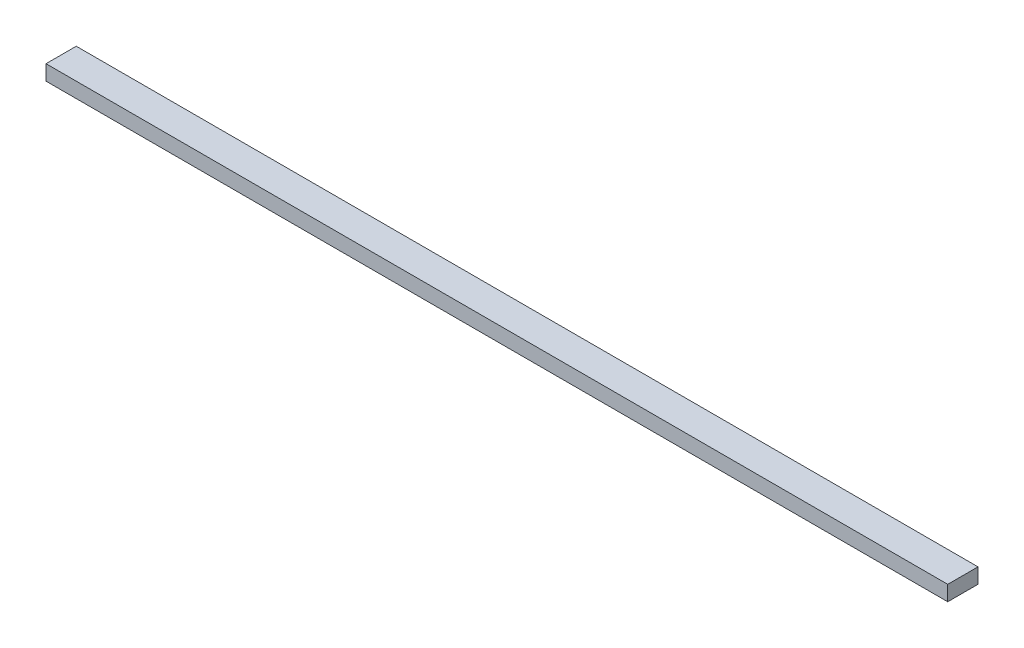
ISO-10303-21;
HEADER;
FILE_DESCRIPTION(('STEP AP214'),'2;1');
FILE_NAME('part.step','',(''),(''),'','','');
FILE_SCHEMA(('AUTOMOTIVE_DESIGN { 1 0 10303 214 1 1 1 1 }'));
ENDSEC;
DATA;
#1=APPLICATION_CONTEXT('core data for automotive mechanical design processes');
#2=APPLICATION_PROTOCOL_DEFINITION('international standard','automotive_design',2000,#1);
#3=PRODUCT_CONTEXT('',#1,'mechanical');
#4=PRODUCT('Part','Part','',(#3));
#5=PRODUCT_RELATED_PRODUCT_CATEGORY('part','',(#4));
#6=PRODUCT_DEFINITION_FORMATION('','',#4);
#7=PRODUCT_DEFINITION_CONTEXT('part definition',#1,'design');
#8=PRODUCT_DEFINITION('design','',#6,#7);
#9=PRODUCT_DEFINITION_SHAPE('','',#8);
#10=(LENGTH_UNIT() NAMED_UNIT(*) SI_UNIT(.MILLI.,.METRE.));
#11=(NAMED_UNIT(*) PLANE_ANGLE_UNIT() SI_UNIT($,.RADIAN.));
#12=(NAMED_UNIT(*) SI_UNIT($,.STERADIAN.) SOLID_ANGLE_UNIT());
#13=UNCERTAINTY_MEASURE_WITH_UNIT(LENGTH_MEASURE(1.E-05),#10,'distance_accuracy_value','');
#14=(GEOMETRIC_REPRESENTATION_CONTEXT(3) GLOBAL_UNCERTAINTY_ASSIGNED_CONTEXT((#13)) GLOBAL_UNIT_ASSIGNED_CONTEXT((#10,
#11,#12)) REPRESENTATION_CONTEXT('',''));
#15=CARTESIAN_POINT('',(0.,0.,0.));
#16=DIRECTION('',(0.,0.,1.));
#17=DIRECTION('',(1.,0.,0.));
#18=AXIS2_PLACEMENT_3D('',#15,#16,#17);
#19=CARTESIAN_POINT('',(0.,5.,0.));
#20=DIRECTION('',(1.,0.,0.));
#21=DIRECTION('',(0.,0.,-1.));
#22=AXIS2_PLACEMENT_3D('',#19,#20,#21);
#23=PLANE('',#22);
#24=DIRECTION('',(0.,0.,1.));
#25=VECTOR('',#24,1.);
#26=CARTESIAN_POINT('',(0.,0.,0.));
#27=LINE('',#26,#25);
#28=CARTESIAN_POINT('',(0.,0.,-10.));
#29=VERTEX_POINT('',#28);
#30=CARTESIAN_POINT('',(0.,0.,0.));
#31=VERTEX_POINT('',#30);
#32=EDGE_CURVE('E70',#29,#31,#27,.T.);
#33=ORIENTED_EDGE('',*,*,#32,.T.);
#34=DIRECTION('',(0.,-1.,0.));
#35=VECTOR('',#34,1.);
#36=CARTESIAN_POINT('',(0.,5.,0.));
#37=LINE('',#36,#35);
#38=CARTESIAN_POINT('',(0.,5.,0.));
#39=VERTEX_POINT('',#38);
#40=EDGE_CURVE('E11',#39,#31,#37,.T.);
#41=ORIENTED_EDGE('',*,*,#40,.F.);
#42=DIRECTION('',(0.,0.,1.));
#43=VECTOR('',#42,1.);
#44=CARTESIAN_POINT('',(0.,5.,0.));
#45=LINE('',#44,#43);
#46=CARTESIAN_POINT('',(0.,5.,-10.));
#47=VERTEX_POINT('',#46);
#48=EDGE_CURVE('E88',#47,#39,#45,.T.);
#49=ORIENTED_EDGE('',*,*,#48,.F.);
#50=DIRECTION('',(0.,-1.,0.));
#51=VECTOR('',#50,1.);
#52=CARTESIAN_POINT('',(0.,5.,-10.));
#53=LINE('',#52,#51);
#54=EDGE_CURVE('E82',#47,#29,#53,.T.);
#55=ORIENTED_EDGE('',*,*,#54,.T.);
#56=EDGE_LOOP('',(#33,#41,#49,#55));
#57=FACE_BOUND('',#56,.T.);
#58=ADVANCED_FACE('F26',(#57),#23,.F.);
#59=CARTESIAN_POINT('',(0.,5.,0.));
#60=DIRECTION('',(0.,0.,-1.));
#61=DIRECTION('',(-1.,0.,0.));
#62=AXIS2_PLACEMENT_3D('',#59,#60,#61);
#63=PLANE('',#62);
#64=DIRECTION('',(1.,0.,0.));
#65=VECTOR('',#64,1.);
#66=CARTESIAN_POINT('',(0.,0.,0.));
#67=LINE('',#66,#65);
#68=CARTESIAN_POINT('',(298.,0.,0.));
#69=VERTEX_POINT('',#68);
#70=EDGE_CURVE('E66',#31,#69,#67,.T.);
#71=ORIENTED_EDGE('',*,*,#70,.T.);
#72=DIRECTION('',(0.,-1.,0.));
#73=VECTOR('',#72,1.);
#74=CARTESIAN_POINT('',(298.,5.,0.));
#75=LINE('',#74,#73);
#76=CARTESIAN_POINT('',(298.,5.,0.));
#77=VERTEX_POINT('',#76);
#78=EDGE_CURVE('E33',#77,#69,#75,.T.);
#79=ORIENTED_EDGE('',*,*,#78,.F.);
#80=DIRECTION('',(1.,0.,0.));
#81=VECTOR('',#80,1.);
#82=CARTESIAN_POINT('',(0.,5.,0.));
#83=LINE('',#82,#81);
#84=EDGE_CURVE('E78',#39,#77,#83,.T.);
#85=ORIENTED_EDGE('',*,*,#84,.F.);
#86=ORIENTED_EDGE('',*,*,#40,.T.);
#87=EDGE_LOOP('',(#71,#79,#85,#86));
#88=FACE_BOUND('',#87,.T.);
#89=ADVANCED_FACE('F77',(#88),#63,.F.);
#90=CARTESIAN_POINT('',(298.,5.,0.));
#91=DIRECTION('',(-1.,0.,0.));
#92=DIRECTION('',(0.,0.,1.));
#93=AXIS2_PLACEMENT_3D('',#90,#91,#92);
#94=PLANE('',#93);
#95=DIRECTION('',(0.,0.,-1.));
#96=VECTOR('',#95,1.);
#97=CARTESIAN_POINT('',(298.,0.,0.));
#98=LINE('',#97,#96);
#99=CARTESIAN_POINT('',(298.,0.,-10.));
#100=VERTEX_POINT('',#99);
#101=EDGE_CURVE('E71',#69,#100,#98,.T.);
#102=ORIENTED_EDGE('',*,*,#101,.T.);
#103=DIRECTION('',(0.,-1.,0.));
#104=VECTOR('',#103,1.);
#105=CARTESIAN_POINT('',(298.,5.,-10.));
#106=LINE('',#105,#104);
#107=CARTESIAN_POINT('',(298.,5.,-10.));
#108=VERTEX_POINT('',#107);
#109=EDGE_CURVE('E94',#108,#100,#106,.T.);
#110=ORIENTED_EDGE('',*,*,#109,.F.);
#111=DIRECTION('',(0.,0.,-1.));
#112=VECTOR('',#111,1.);
#113=CARTESIAN_POINT('',(298.,5.,0.));
#114=LINE('',#113,#112);
#115=EDGE_CURVE('E45',#77,#108,#114,.T.);
#116=ORIENTED_EDGE('',*,*,#115,.F.);
#117=ORIENTED_EDGE('',*,*,#78,.T.);
#118=EDGE_LOOP('',(#102,#110,#116,#117));
#119=FACE_BOUND('',#118,.T.);
#120=ADVANCED_FACE('F97',(#119),#94,.F.);
#121=CARTESIAN_POINT('',(0.,5.,-10.));
#122=DIRECTION('',(0.,0.,1.));
#123=DIRECTION('',(1.,0.,0.));
#124=AXIS2_PLACEMENT_3D('',#121,#122,#123);
#125=PLANE('',#124);
#126=DIRECTION('',(-1.,0.,0.));
#127=VECTOR('',#126,1.);
#128=CARTESIAN_POINT('',(0.,0.,-10.));
#129=LINE('',#128,#127);
#130=EDGE_CURVE('E86',#100,#29,#129,.T.);
#131=ORIENTED_EDGE('',*,*,#130,.T.);
#132=ORIENTED_EDGE('',*,*,#54,.F.);
#133=DIRECTION('',(-1.,0.,0.));
#134=VECTOR('',#133,1.);
#135=CARTESIAN_POINT('',(0.,5.,-10.));
#136=LINE('',#135,#134);
#137=EDGE_CURVE('E40',#108,#47,#136,.T.);
#138=ORIENTED_EDGE('',*,*,#137,.F.);
#139=ORIENTED_EDGE('',*,*,#109,.T.);
#140=EDGE_LOOP('',(#131,#132,#138,#139));
#141=FACE_BOUND('',#140,.T.);
#142=ADVANCED_FACE('F99',(#141),#125,.F.);
#143=CARTESIAN_POINT('',(0.,5.,-10.));
#144=DIRECTION('',(0.,-1.,0.));
#145=DIRECTION('',(0.,0.,-1.));
#146=AXIS2_PLACEMENT_3D('',#143,#144,#145);
#147=PLANE('',#146);
#148=ORIENTED_EDGE('',*,*,#48,.T.);
#149=ORIENTED_EDGE('',*,*,#84,.T.);
#150=ORIENTED_EDGE('',*,*,#115,.T.);
#151=ORIENTED_EDGE('',*,*,#137,.T.);
#152=EDGE_LOOP('',(#148,#149,#150,#151));
#153=FACE_BOUND('',#152,.T.);
#154=ADVANCED_FACE('F100',(#153),#147,.F.);
#155=CARTESIAN_POINT('',(0.,0.,-10.));
#156=DIRECTION('',(0.,-1.,0.));
#157=DIRECTION('',(0.,0.,-1.));
#158=AXIS2_PLACEMENT_3D('',#155,#156,#157);
#159=PLANE('',#158);
#160=ORIENTED_EDGE('',*,*,#32,.F.);
#161=ORIENTED_EDGE('',*,*,#130,.F.);
#162=ORIENTED_EDGE('',*,*,#101,.F.);
#163=ORIENTED_EDGE('',*,*,#70,.F.);
#164=EDGE_LOOP('',(#160,#161,#162,#163));
#165=FACE_BOUND('',#164,.T.);
#166=ADVANCED_FACE('F67',(#165),#159,.T.);
#167=CLOSED_SHELL('',(#58,#89,#120,#142,#154,#166));
#168=MANIFOLD_SOLID_BREP('B2',#167);
#169=ADVANCED_BREP_SHAPE_REPRESENTATION('',(#18,#168),#14);
#170=SHAPE_DEFINITION_REPRESENTATION(#9,#169);
ENDSEC;
END-ISO-10303-21;
